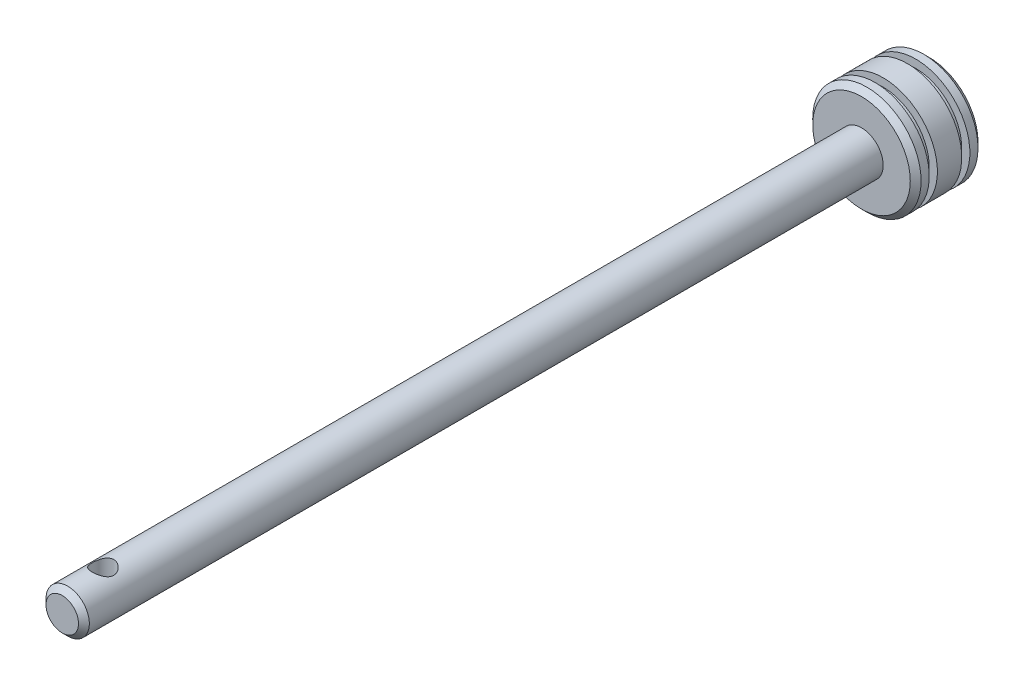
ISO-10303-21;
HEADER;
FILE_DESCRIPTION(('STEP AP214'),'2;1');
FILE_NAME('part.step','',(''),(''),'','','');
FILE_SCHEMA(('AUTOMOTIVE_DESIGN { 1 0 10303 214 1 1 1 1 }'));
ENDSEC;
DATA;
#1=APPLICATION_CONTEXT('core data for automotive mechanical design processes');
#2=APPLICATION_PROTOCOL_DEFINITION('international standard','automotive_design',2000,#1);
#3=PRODUCT_CONTEXT('',#1,'mechanical');
#4=PRODUCT('Part','Part','',(#3));
#5=PRODUCT_RELATED_PRODUCT_CATEGORY('part','',(#4));
#6=PRODUCT_DEFINITION_FORMATION('','',#4);
#7=PRODUCT_DEFINITION_CONTEXT('part definition',#1,'design');
#8=PRODUCT_DEFINITION('design','',#6,#7);
#9=PRODUCT_DEFINITION_SHAPE('','',#8);
#10=(LENGTH_UNIT() NAMED_UNIT(*) SI_UNIT(.MILLI.,.METRE.));
#11=(NAMED_UNIT(*) PLANE_ANGLE_UNIT() SI_UNIT($,.RADIAN.));
#12=(NAMED_UNIT(*) SI_UNIT($,.STERADIAN.) SOLID_ANGLE_UNIT());
#13=UNCERTAINTY_MEASURE_WITH_UNIT(LENGTH_MEASURE(1.E-05),#10,'distance_accuracy_value','');
#14=(GEOMETRIC_REPRESENTATION_CONTEXT(3) GLOBAL_UNCERTAINTY_ASSIGNED_CONTEXT((#13)) GLOBAL_UNIT_ASSIGNED_CONTEXT((#10,
#11,#12)) REPRESENTATION_CONTEXT('',''));
#15=CARTESIAN_POINT('',(0.,0.,0.));
#16=DIRECTION('',(0.,0.,1.));
#17=DIRECTION('',(1.,0.,0.));
#18=AXIS2_PLACEMENT_3D('',#15,#16,#17);
#19=CARTESIAN_POINT('',(0.,0.,25.));
#20=DIRECTION('',(0.,0.,-1.));
#21=DIRECTION('',(-1.,0.,0.));
#22=AXIS2_PLACEMENT_3D('',#19,#20,#21);
#23=CYLINDRICAL_SURFACE('',#22,20.);
#24=CARTESIAN_POINT('',(0.,0.,20.));
#25=DIRECTION('',(0.,0.,-1.));
#26=DIRECTION('',(-1.,0.,0.));
#27=AXIS2_PLACEMENT_3D('',#24,#25,#26);
#28=CIRCLE('',#27,20.);
#29=CARTESIAN_POINT('',(-20.,0.,20.));
#30=VERTEX_POINT('',#29);
#31=EDGE_CURVE('E151',#30,#30,#28,.T.);
#32=ORIENTED_EDGE('',*,*,#31,.F.);
#33=EDGE_LOOP('',(#32));
#34=FACE_BOUND('',#33,.T.);
#35=CARTESIAN_POINT('',(0.,0.,23.));
#36=DIRECTION('',(0.,0.,1.));
#37=DIRECTION('',(1.,0.,0.));
#38=AXIS2_PLACEMENT_3D('',#35,#36,#37);
#39=CIRCLE('',#38,20.);
#40=CARTESIAN_POINT('',(20.,0.,23.));
#41=VERTEX_POINT('',#40);
#42=EDGE_CURVE('E126',#41,#41,#39,.F.);
#43=ORIENTED_EDGE('',*,*,#42,.T.);
#44=EDGE_LOOP('',(#43));
#45=FACE_BOUND('',#44,.T.);
#46=ADVANCED_FACE('F24',(#34,#45),#23,.T.);
#47=CARTESIAN_POINT('',(0.,0.,25.));
#48=DIRECTION('',(0.,0.,1.));
#49=DIRECTION('',(1.,0.,0.));
#50=AXIS2_PLACEMENT_3D('',#47,#48,#49);
#51=PLANE('',#50);
#52=CARTESIAN_POINT('',(0.,0.,25.));
#53=DIRECTION('',(0.,0.,1.));
#54=DIRECTION('',(1.,0.,0.));
#55=AXIS2_PLACEMENT_3D('',#52,#53,#54);
#56=CIRCLE('',#55,18.);
#57=CARTESIAN_POINT('',(18.,0.,25.));
#58=VERTEX_POINT('',#57);
#59=EDGE_CURVE('E41',#58,#58,#56,.T.);
#60=ORIENTED_EDGE('',*,*,#59,.T.);
#61=EDGE_LOOP('',(#60));
#62=FACE_BOUND('',#61,.T.);
#63=CARTESIAN_POINT('',(0.,0.,25.));
#64=DIRECTION('',(0.,0.,1.));
#65=DIRECTION('',(1.,0.,0.));
#66=AXIS2_PLACEMENT_3D('',#63,#64,#65);
#67=CIRCLE('',#66,8.);
#68=CARTESIAN_POINT('',(8.,0.,25.));
#69=VERTEX_POINT('',#68);
#70=EDGE_CURVE('E131',#69,#69,#67,.T.);
#71=ORIENTED_EDGE('',*,*,#70,.F.);
#72=EDGE_LOOP('',(#71));
#73=FACE_BOUND('',#72,.T.);
#74=ADVANCED_FACE('F102',(#62,#73),#51,.T.);
#75=CARTESIAN_POINT('',(0.,0.,320.));
#76=DIRECTION('',(0.,0.,-1.));
#77=DIRECTION('',(-1.,0.,0.));
#78=AXIS2_PLACEMENT_3D('',#75,#76,#77);
#79=CYLINDRICAL_SURFACE('',#78,8.);
#80=CARTESIAN_POINT('',(0.,-8.,309.));
#81=CARTESIAN_POINT('',(0.105191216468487,-7.99999964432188,308.999999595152));
#82=CARTESIAN_POINT('',(0.210389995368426,-7.99792027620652,308.995845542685));
#83=CARTESIAN_POINT('',(0.420011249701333,-7.98965597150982,308.979277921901));
#84=CARTESIAN_POINT('',(0.524433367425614,-7.98346924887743,308.96686076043));
#85=CARTESIAN_POINT('',(0.731828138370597,-7.96713597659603,308.933886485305));
#86=CARTESIAN_POINT('',(0.834798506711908,-7.95698378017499,308.913317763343));
#87=CARTESIAN_POINT('',(1.03841520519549,-7.93298382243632,308.864282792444));
#88=CARTESIAN_POINT('',(1.1390605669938,-7.91913455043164,308.835813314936));
#89=CARTESIAN_POINT('',(1.43561775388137,-7.87265974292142,308.739251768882));
#90=CARTESIAN_POINT('',(1.62719620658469,-7.83501976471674,308.659837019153));
#91=CARTESIAN_POINT('',(1.9939214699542,-7.74982886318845,308.473710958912));
#92=CARTESIAN_POINT('',(2.16906957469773,-7.70227872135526,308.367001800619));
#93=CARTESIAN_POINT('',(2.51002321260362,-7.59825056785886,308.121930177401));
#94=CARTESIAN_POINT('',(2.67462250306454,-7.54140647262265,307.982043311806));
#95=CARTESIAN_POINT('',(2.97911611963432,-7.42640030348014,307.677924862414));
#96=CARTESIAN_POINT('',(3.11899161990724,-7.3682372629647,307.513674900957));
#97=CARTESIAN_POINT('',(3.38102385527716,-7.25195135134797,307.15002101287));
#98=CARTESIAN_POINT('',(3.50096528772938,-7.19418138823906,306.948878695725));
#99=CARTESIAN_POINT('',(3.65378721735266,-7.11709930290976,306.632065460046));
#100=CARTESIAN_POINT('',(3.70022392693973,-7.09299422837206,306.523905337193));
#101=CARTESIAN_POINT('',(3.78359067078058,-7.04887690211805,306.303199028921));
#102=CARTESIAN_POINT('',(3.82052633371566,-7.02886222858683,306.190655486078));
#103=CARTESIAN_POINT('',(3.88251046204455,-6.99480449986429,305.968805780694));
#104=CARTESIAN_POINT('',(3.90813408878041,-6.98047764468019,305.859703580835));
#105=CARTESIAN_POINT('',(3.95018060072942,-6.95677065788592,305.63925947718));
#106=CARTESIAN_POINT('',(3.96660836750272,-6.94738790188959,305.527918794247));
#107=CARTESIAN_POINT('',(3.99001913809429,-6.93396933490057,305.303993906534));
#108=CARTESIAN_POINT('',(3.99700782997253,-6.92993030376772,305.191410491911));
#109=CARTESIAN_POINT('',(4.00144340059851,-6.92737022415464,304.965999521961));
#110=CARTESIAN_POINT('',(3.99889118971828,-6.92884864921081,304.853171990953));
#111=CARTESIAN_POINT('',(3.98516575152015,-6.93675038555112,304.641835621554));
#112=CARTESIAN_POINT('',(3.9750632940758,-6.94255931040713,304.543232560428));
#113=CARTESIAN_POINT('',(3.94763759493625,-6.95818925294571,304.347348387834));
#114=CARTESIAN_POINT('',(3.9303120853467,-6.96801153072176,304.25006770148));
#115=CARTESIAN_POINT('',(3.86777248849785,-7.00304835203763,303.9612208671));
#116=CARTESIAN_POINT('',(3.81198555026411,-7.03383903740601,303.772504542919));
#117=CARTESIAN_POINT('',(3.6728359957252,-7.10749917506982,303.403053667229));
#118=CARTESIAN_POINT('',(3.58886132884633,-7.15063327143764,303.222607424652));
#119=CARTESIAN_POINT('',(3.39616568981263,-7.2441365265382,302.877469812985));
#120=CARTESIAN_POINT('',(3.28743360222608,-7.29450893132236,302.712785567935));
#121=CARTESIAN_POINT('',(3.03227252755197,-7.40452458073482,302.381917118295));
#122=CARTESIAN_POINT('',(2.88281182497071,-7.46453347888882,302.218190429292));
#123=CARTESIAN_POINT('',(2.55818830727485,-7.58191186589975,301.9170403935));
#124=CARTESIAN_POINT('',(2.38301327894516,-7.63928008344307,301.779629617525));
#125=CARTESIAN_POINT('',(2.09944472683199,-7.72027607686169,301.593246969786));
#126=CARTESIAN_POINT('',(1.9989679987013,-7.74696304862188,301.533318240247));
#127=CARTESIAN_POINT('',(1.79256850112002,-7.79730441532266,301.422233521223));
#128=CARTESIAN_POINT('',(1.68664805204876,-7.82096008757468,301.371073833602));
#129=CARTESIAN_POINT('',(1.47010242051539,-7.86454042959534,301.278080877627));
#130=CARTESIAN_POINT('',(1.35947915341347,-7.88446660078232,301.236243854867));
#131=CARTESIAN_POINT('',(1.13432950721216,-7.91999221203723,301.162380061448));
#132=CARTESIAN_POINT('',(1.01980357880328,-7.9355921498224,301.130352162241));
#133=CARTESIAN_POINT('',(0.797438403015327,-7.96087677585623,301.078773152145));
#134=CARTESIAN_POINT('',(0.689830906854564,-7.9709443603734,301.058408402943));
#135=CARTESIAN_POINT('',(0.47299872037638,-7.98674429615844,301.026553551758));
#136=CARTESIAN_POINT('',(0.363774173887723,-7.99247703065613,301.015062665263));
#137=CARTESIAN_POINT('',(0.144648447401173,-7.99944300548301,301.001109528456));
#138=CARTESIAN_POINT('',(0.0347475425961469,-8.00067796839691,300.998643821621));
#139=CARTESIAN_POINT('',(-0.184837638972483,-7.99861804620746,301.00276424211));
#140=CARTESIAN_POINT('',(-0.294521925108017,-7.99532336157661,301.009349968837));
#141=CARTESIAN_POINT('',(-0.504259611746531,-7.98472734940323,301.030623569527));
#142=CARTESIAN_POINT('',(-0.604398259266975,-7.97775776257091,301.044641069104));
#143=CARTESIAN_POINT('',(-0.803035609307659,-7.96021983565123,301.080136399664));
#144=CARTESIAN_POINT('',(-0.901533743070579,-7.94965027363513,301.101616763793));
#145=CARTESIAN_POINT('',(-1.19351737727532,-7.91289127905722,301.1769351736));
#146=CARTESIAN_POINT('',(-1.38368108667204,-7.88164133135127,301.241670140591));
#147=CARTESIAN_POINT('',(-1.75558493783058,-7.80736894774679,301.399998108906));
#148=CARTESIAN_POINT('',(-1.93692876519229,-7.76403545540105,301.494363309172));
#149=CARTESIAN_POINT('',(-2.28183826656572,-7.66975878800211,301.70843103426));
#150=CARTESIAN_POINT('',(-2.44539632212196,-7.61881237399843,301.828144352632));
#151=CARTESIAN_POINT('',(-2.76706877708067,-7.50833088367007,302.103033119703));
#152=CARTESIAN_POINT('',(-2.92307134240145,-7.44844369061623,302.260536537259));
#153=CARTESIAN_POINT('',(-3.20744226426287,-7.33048735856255,302.599735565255));
#154=CARTESIAN_POINT('',(-3.33579150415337,-7.27241950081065,302.781447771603));
#155=CARTESIAN_POINT('',(-3.50772930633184,-7.1902816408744,303.073994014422));
#156=CARTESIAN_POINT('',(-3.56261578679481,-7.16316684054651,303.177483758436));
#157=CARTESIAN_POINT('',(-3.66334616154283,-7.11217812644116,303.389518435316));
#158=CARTESIAN_POINT('',(-3.70919441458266,-7.08830265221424,303.498060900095));
#159=CARTESIAN_POINT('',(-3.79131200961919,-7.04472262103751,303.719421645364));
#160=CARTESIAN_POINT('',(-3.82758904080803,-7.02501471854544,303.832236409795));
#161=CARTESIAN_POINT('',(-3.8901200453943,-6.99058253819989,304.061352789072));
#162=CARTESIAN_POINT('',(-3.91637557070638,-6.9758574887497,304.177653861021));
#163=CARTESIAN_POINT('',(-3.95643062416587,-6.9532102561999,304.401412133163));
#164=CARTESIAN_POINT('',(-3.97118378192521,-6.94477079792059,304.508646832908));
#165=CARTESIAN_POINT('',(-3.99195118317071,-6.93285441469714,304.724227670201));
#166=CARTESIAN_POINT('',(-3.99796634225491,-6.92937696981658,304.832573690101));
#167=CARTESIAN_POINT('',(-4.00116308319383,-6.92753208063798,305.04940749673));
#168=CARTESIAN_POINT('',(-3.9983477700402,-6.92916284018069,305.157895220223));
#169=CARTESIAN_POINT('',(-3.98394653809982,-6.9374509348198,305.374061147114));
#170=CARTESIAN_POINT('',(-3.97236097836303,-6.94410806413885,305.481739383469));
#171=CARTESIAN_POINT('',(-3.92770249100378,-6.9695287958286,305.781800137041));
#172=CARTESIAN_POINT('',(-3.88483285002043,-6.99372760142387,305.972365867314));
#173=CARTESIAN_POINT('',(-3.77270184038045,-7.05483682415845,306.343268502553));
#174=CARTESIAN_POINT('',(-3.70343198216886,-7.09175132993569,306.523602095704));
#175=CARTESIAN_POINT('',(-3.53526338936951,-7.17714225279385,306.882488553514));
#176=CARTESIAN_POINT('',(-3.43468670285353,-7.22622883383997,307.060107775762));
#177=CARTESIAN_POINT('',(-3.20860173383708,-7.3294133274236,307.397101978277));
#178=CARTESIAN_POINT('',(-3.08308048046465,-7.38351383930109,307.556467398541));
#179=CARTESIAN_POINT('',(-2.7928225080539,-7.49849148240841,307.872562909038));
#180=CARTESIAN_POINT('',(-2.625174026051,-7.55939328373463,308.026619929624));
#181=CARTESIAN_POINT('',(-2.26458287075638,-7.67511613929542,308.305068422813));
#182=CARTESIAN_POINT('',(-2.0716266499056,-7.72993390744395,308.429443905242));
#183=CARTESIAN_POINT('',(-1.76603106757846,-7.80335210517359,308.590904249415));
#184=CARTESIAN_POINT('',(-1.66100410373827,-7.82643367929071,308.640693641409));
#185=CARTESIAN_POINT('',(-1.44639623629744,-7.8689179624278,308.731148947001));
#186=CARTESIAN_POINT('',(-1.33681760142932,-7.8883224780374,308.771819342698));
#187=CARTESIAN_POINT('',(-1.11415600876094,-7.92283587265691,308.843476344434));
#188=CARTESIAN_POINT('',(-1.00108129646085,-7.93795411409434,308.874484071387));
#189=CARTESIAN_POINT('',(-0.772189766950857,-7.96347694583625,308.926510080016));
#190=CARTESIAN_POINT('',(-0.65637467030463,-7.97388441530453,308.947534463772));
#191=CARTESIAN_POINT('',(-0.450433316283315,-7.98781110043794,308.975579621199));
#192=CARTESIAN_POINT('',(-0.36066062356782,-7.99237392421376,308.984729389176));
#193=CARTESIAN_POINT('',(-0.18059382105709,-7.99846856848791,308.996939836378));
#194=CARTESIAN_POINT('',(-0.090299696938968,-8.00000030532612,309.000000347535));
#195=CARTESIAN_POINT('',(0.,-8.,309.));
#196=B_SPLINE_CURVE_WITH_KNOTS('',3,(#80,#81,#82,#83,#84,#85,#86,#87,#88,#89,#90,#91,#92,#93,
#94,#95,#96,#97,#98,#99,#100,#101,#102,#103,#104,#105,#106,#107,#108,#109,#110,#111,#112,#113,
#114,#115,#116,#117,#118,#119,#120,#121,#122,#123,#124,#125,#126,#127,#128,#129,#130,#131,#132,
#133,#134,#135,#136,#137,#138,#139,#140,#141,#142,#143,#144,#145,#146,#147,#148,#149,#150,#151,
#152,#153,#154,#155,#156,#157,#158,#159,#160,#161,#162,#163,#164,#165,#166,#167,#168,#169,#170,
#171,#172,#173,#174,#175,#176,#177,#178,#179,#180,#181,#182,#183,#184,#185,#186,#187,#188,#189,
#190,#191,#192,#193,#194,#195),.UNSPECIFIED.,.T.,.F.,(4,2,2,2,2,2,2,2,2,2,2,2,2,2,2,2,2,2,2,2,2,
2,2,2,2,2,2,2,2,2,2,2,2,2,2,2,2,2,2,2,2,2,2,2,2,2,2,2,2,2,2,2,2,2,2,2,2,4),(0.,
0.315484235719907,0.631105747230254,0.947178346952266,1.26338029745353,1.89263632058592,
2.52184274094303,3.18911473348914,3.85689264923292,4.57645675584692,4.93648208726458,
5.29629363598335,5.63476191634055,5.97305035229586,6.31113484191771,6.64918707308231,
6.9466914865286,7.24428938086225,7.83905304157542,8.44767049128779,9.05656173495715,
9.74265853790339,10.4290822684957,10.7886699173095,11.1481055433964,11.5073961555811,
11.8666454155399,12.1961419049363,12.5256092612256,12.8549504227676,13.184277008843,
13.4879760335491,13.791778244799,14.3988188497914,15.0232162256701,15.6478800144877,
16.33388641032,17.0203655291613,17.380682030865,17.7408243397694,18.1006764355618,
18.4604727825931,18.7857371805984,19.1109674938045,19.4360834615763,19.7611861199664,
20.3488209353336,20.9366448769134,21.5639619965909,22.1916061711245,22.8955134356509,
23.5997990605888,23.9548906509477,24.3098073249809,24.6639426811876,25.0178613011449,
25.2886761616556,25.5594984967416),.UNSPECIFIED.);
#197=CARTESIAN_POINT('',(0.,-8.,309.));
#198=VERTEX_POINT('',#197);
#199=EDGE_CURVE('E28',#198,#198,#196,.T.);
#200=ORIENTED_EDGE('',*,*,#199,.T.);
#201=EDGE_LOOP('',(#200));
#202=FACE_BOUND('',#201,.T.);
#203=CARTESIAN_POINT('',(0.,8.,309.));
#204=CARTESIAN_POINT('',(-0.105191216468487,7.99999964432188,308.999999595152));
#205=CARTESIAN_POINT('',(-0.210389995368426,7.99792027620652,308.995845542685));
#206=CARTESIAN_POINT('',(-0.420011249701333,7.98965597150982,308.979277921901));
#207=CARTESIAN_POINT('',(-0.524433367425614,7.98346924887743,308.96686076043));
#208=CARTESIAN_POINT('',(-0.731828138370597,7.96713597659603,308.933886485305));
#209=CARTESIAN_POINT('',(-0.834798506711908,7.95698378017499,308.913317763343));
#210=CARTESIAN_POINT('',(-1.03841520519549,7.93298382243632,308.864282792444));
#211=CARTESIAN_POINT('',(-1.1390605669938,7.91913455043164,308.835813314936));
#212=CARTESIAN_POINT('',(-1.43561775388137,7.87265974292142,308.739251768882));
#213=CARTESIAN_POINT('',(-1.62719620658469,7.83501976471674,308.659837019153));
#214=CARTESIAN_POINT('',(-1.9939214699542,7.74982886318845,308.473710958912));
#215=CARTESIAN_POINT('',(-2.16906957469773,7.70227872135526,308.367001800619));
#216=CARTESIAN_POINT('',(-2.51002321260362,7.59825056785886,308.121930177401));
#217=CARTESIAN_POINT('',(-2.67462250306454,7.54140647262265,307.982043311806));
#218=CARTESIAN_POINT('',(-2.97911611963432,7.42640030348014,307.677924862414));
#219=CARTESIAN_POINT('',(-3.11899161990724,7.3682372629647,307.513674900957));
#220=CARTESIAN_POINT('',(-3.38102385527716,7.25195135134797,307.15002101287));
#221=CARTESIAN_POINT('',(-3.50096528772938,7.19418138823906,306.948878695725));
#222=CARTESIAN_POINT('',(-3.65378721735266,7.11709930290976,306.632065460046));
#223=CARTESIAN_POINT('',(-3.70022392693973,7.09299422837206,306.523905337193));
#224=CARTESIAN_POINT('',(-3.78359067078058,7.04887690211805,306.303199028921));
#225=CARTESIAN_POINT('',(-3.82052633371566,7.02886222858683,306.190655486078));
#226=CARTESIAN_POINT('',(-3.88251046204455,6.99480449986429,305.968805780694));
#227=CARTESIAN_POINT('',(-3.90813408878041,6.98047764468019,305.859703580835));
#228=CARTESIAN_POINT('',(-3.95018060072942,6.95677065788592,305.63925947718));
#229=CARTESIAN_POINT('',(-3.96660836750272,6.94738790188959,305.527918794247));
#230=CARTESIAN_POINT('',(-3.99001913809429,6.93396933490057,305.303993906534));
#231=CARTESIAN_POINT('',(-3.99700782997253,6.92993030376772,305.191410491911));
#232=CARTESIAN_POINT('',(-4.00144340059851,6.92737022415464,304.965999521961));
#233=CARTESIAN_POINT('',(-3.99889118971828,6.92884864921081,304.853171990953));
#234=CARTESIAN_POINT('',(-3.98516575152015,6.93675038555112,304.641835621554));
#235=CARTESIAN_POINT('',(-3.9750632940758,6.94255931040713,304.543232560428));
#236=CARTESIAN_POINT('',(-3.94763759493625,6.95818925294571,304.347348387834));
#237=CARTESIAN_POINT('',(-3.9303120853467,6.96801153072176,304.25006770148));
#238=CARTESIAN_POINT('',(-3.86777248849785,7.00304835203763,303.9612208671));
#239=CARTESIAN_POINT('',(-3.81198555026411,7.03383903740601,303.772504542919));
#240=CARTESIAN_POINT('',(-3.6728359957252,7.10749917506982,303.403053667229));
#241=CARTESIAN_POINT('',(-3.58886132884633,7.15063327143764,303.222607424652));
#242=CARTESIAN_POINT('',(-3.39616568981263,7.2441365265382,302.877469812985));
#243=CARTESIAN_POINT('',(-3.28743360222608,7.29450893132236,302.712785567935));
#244=CARTESIAN_POINT('',(-3.03227252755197,7.40452458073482,302.381917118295));
#245=CARTESIAN_POINT('',(-2.88281182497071,7.46453347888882,302.218190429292));
#246=CARTESIAN_POINT('',(-2.55818830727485,7.58191186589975,301.9170403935));
#247=CARTESIAN_POINT('',(-2.38301327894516,7.63928008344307,301.779629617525));
#248=CARTESIAN_POINT('',(-2.09944472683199,7.72027607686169,301.593246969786));
#249=CARTESIAN_POINT('',(-1.9989679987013,7.74696304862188,301.533318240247));
#250=CARTESIAN_POINT('',(-1.79256850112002,7.79730441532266,301.422233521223));
#251=CARTESIAN_POINT('',(-1.68664805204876,7.82096008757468,301.371073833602));
#252=CARTESIAN_POINT('',(-1.47010242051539,7.86454042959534,301.278080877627));
#253=CARTESIAN_POINT('',(-1.35947915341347,7.88446660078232,301.236243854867));
#254=CARTESIAN_POINT('',(-1.13432950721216,7.91999221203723,301.162380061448));
#255=CARTESIAN_POINT('',(-1.01980357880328,7.9355921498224,301.130352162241));
#256=CARTESIAN_POINT('',(-0.797438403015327,7.96087677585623,301.078773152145));
#257=CARTESIAN_POINT('',(-0.689830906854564,7.9709443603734,301.058408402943));
#258=CARTESIAN_POINT('',(-0.47299872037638,7.98674429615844,301.026553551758));
#259=CARTESIAN_POINT('',(-0.363774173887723,7.99247703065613,301.015062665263));
#260=CARTESIAN_POINT('',(-0.144648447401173,7.99944300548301,301.001109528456));
#261=CARTESIAN_POINT('',(-0.0347475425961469,8.00067796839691,300.998643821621));
#262=CARTESIAN_POINT('',(0.184837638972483,7.99861804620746,301.00276424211));
#263=CARTESIAN_POINT('',(0.294521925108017,7.99532336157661,301.009349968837));
#264=CARTESIAN_POINT('',(0.504259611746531,7.98472734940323,301.030623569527));
#265=CARTESIAN_POINT('',(0.604398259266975,7.97775776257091,301.044641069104));
#266=CARTESIAN_POINT('',(0.803035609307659,7.96021983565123,301.080136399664));
#267=CARTESIAN_POINT('',(0.901533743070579,7.94965027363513,301.101616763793));
#268=CARTESIAN_POINT('',(1.19351737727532,7.91289127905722,301.1769351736));
#269=CARTESIAN_POINT('',(1.38368108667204,7.88164133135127,301.241670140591));
#270=CARTESIAN_POINT('',(1.75558493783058,7.80736894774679,301.399998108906));
#271=CARTESIAN_POINT('',(1.93692876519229,7.76403545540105,301.494363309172));
#272=CARTESIAN_POINT('',(2.28183826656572,7.66975878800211,301.70843103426));
#273=CARTESIAN_POINT('',(2.44539632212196,7.61881237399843,301.828144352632));
#274=CARTESIAN_POINT('',(2.76706877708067,7.50833088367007,302.103033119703));
#275=CARTESIAN_POINT('',(2.92307134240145,7.44844369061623,302.260536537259));
#276=CARTESIAN_POINT('',(3.20744226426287,7.33048735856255,302.599735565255));
#277=CARTESIAN_POINT('',(3.33579150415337,7.27241950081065,302.781447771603));
#278=CARTESIAN_POINT('',(3.50772930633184,7.1902816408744,303.073994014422));
#279=CARTESIAN_POINT('',(3.56261578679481,7.16316684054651,303.177483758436));
#280=CARTESIAN_POINT('',(3.66334616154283,7.11217812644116,303.389518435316));
#281=CARTESIAN_POINT('',(3.70919441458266,7.08830265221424,303.498060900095));
#282=CARTESIAN_POINT('',(3.79131200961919,7.04472262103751,303.719421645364));
#283=CARTESIAN_POINT('',(3.82758904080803,7.02501471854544,303.832236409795));
#284=CARTESIAN_POINT('',(3.8901200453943,6.99058253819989,304.061352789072));
#285=CARTESIAN_POINT('',(3.91637557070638,6.9758574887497,304.177653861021));
#286=CARTESIAN_POINT('',(3.95643062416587,6.9532102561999,304.401412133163));
#287=CARTESIAN_POINT('',(3.97118378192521,6.94477079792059,304.508646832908));
#288=CARTESIAN_POINT('',(3.99195118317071,6.93285441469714,304.724227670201));
#289=CARTESIAN_POINT('',(3.99796634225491,6.92937696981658,304.832573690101));
#290=CARTESIAN_POINT('',(4.00116308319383,6.92753208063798,305.04940749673));
#291=CARTESIAN_POINT('',(3.9983477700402,6.92916284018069,305.157895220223));
#292=CARTESIAN_POINT('',(3.98394653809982,6.9374509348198,305.374061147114));
#293=CARTESIAN_POINT('',(3.97236097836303,6.94410806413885,305.481739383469));
#294=CARTESIAN_POINT('',(3.92770249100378,6.9695287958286,305.781800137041));
#295=CARTESIAN_POINT('',(3.88483285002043,6.99372760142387,305.972365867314));
#296=CARTESIAN_POINT('',(3.77270184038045,7.05483682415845,306.343268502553));
#297=CARTESIAN_POINT('',(3.70343198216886,7.09175132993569,306.523602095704));
#298=CARTESIAN_POINT('',(3.53526338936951,7.17714225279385,306.882488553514));
#299=CARTESIAN_POINT('',(3.43468670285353,7.22622883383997,307.060107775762));
#300=CARTESIAN_POINT('',(3.20860173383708,7.3294133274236,307.397101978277));
#301=CARTESIAN_POINT('',(3.08308048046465,7.38351383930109,307.556467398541));
#302=CARTESIAN_POINT('',(2.7928225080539,7.49849148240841,307.872562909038));
#303=CARTESIAN_POINT('',(2.625174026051,7.55939328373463,308.026619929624));
#304=CARTESIAN_POINT('',(2.26458287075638,7.67511613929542,308.305068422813));
#305=CARTESIAN_POINT('',(2.0716266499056,7.72993390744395,308.429443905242));
#306=CARTESIAN_POINT('',(1.76603106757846,7.80335210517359,308.590904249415));
#307=CARTESIAN_POINT('',(1.66100410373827,7.82643367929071,308.640693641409));
#308=CARTESIAN_POINT('',(1.44639623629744,7.8689179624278,308.731148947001));
#309=CARTESIAN_POINT('',(1.33681760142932,7.8883224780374,308.771819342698));
#310=CARTESIAN_POINT('',(1.11415600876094,7.92283587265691,308.843476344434));
#311=CARTESIAN_POINT('',(1.00108129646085,7.93795411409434,308.874484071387));
#312=CARTESIAN_POINT('',(0.772189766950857,7.96347694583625,308.926510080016));
#313=CARTESIAN_POINT('',(0.65637467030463,7.97388441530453,308.947534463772));
#314=CARTESIAN_POINT('',(0.450433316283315,7.98781110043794,308.975579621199));
#315=CARTESIAN_POINT('',(0.36066062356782,7.99237392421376,308.984729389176));
#316=CARTESIAN_POINT('',(0.18059382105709,7.99846856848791,308.996939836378));
#317=CARTESIAN_POINT('',(0.090299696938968,8.00000030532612,309.000000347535));
#318=CARTESIAN_POINT('',(0.,8.,309.));
#319=B_SPLINE_CURVE_WITH_KNOTS('',3,(#203,#204,#205,#206,#207,#208,#209,#210,#211,#212,#213,
#214,#215,#216,#217,#218,#219,#220,#221,#222,#223,#224,#225,#226,#227,#228,#229,#230,#231,#232,
#233,#234,#235,#236,#237,#238,#239,#240,#241,#242,#243,#244,#245,#246,#247,#248,#249,#250,#251,
#252,#253,#254,#255,#256,#257,#258,#259,#260,#261,#262,#263,#264,#265,#266,#267,#268,#269,#270,
#271,#272,#273,#274,#275,#276,#277,#278,#279,#280,#281,#282,#283,#284,#285,#286,#287,#288,#289,
#290,#291,#292,#293,#294,#295,#296,#297,#298,#299,#300,#301,#302,#303,#304,#305,#306,#307,#308,
#309,#310,#311,#312,#313,#314,#315,#316,#317,#318),.UNSPECIFIED.,.T.,.F.,(4,2,2,2,2,2,2,2,2,2,2,
2,2,2,2,2,2,2,2,2,2,2,2,2,2,2,2,2,2,2,2,2,2,2,2,2,2,2,2,2,2,2,2,2,2,2,2,2,2,2,2,2,2,2,2,2,2,4),
(0.,0.315484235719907,0.631105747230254,0.947178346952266,1.26338029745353,1.89263632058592,
2.52184274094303,3.18911473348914,3.85689264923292,4.57645675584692,4.93648208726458,
5.29629363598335,5.63476191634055,5.97305035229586,6.31113484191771,6.64918707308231,
6.9466914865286,7.24428938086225,7.83905304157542,8.44767049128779,9.05656173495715,
9.74265853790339,10.4290822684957,10.7886699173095,11.1481055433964,11.5073961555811,
11.8666454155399,12.1961419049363,12.5256092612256,12.8549504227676,13.184277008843,
13.4879760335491,13.791778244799,14.3988188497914,15.0232162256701,15.6478800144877,
16.33388641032,17.0203655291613,17.380682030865,17.7408243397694,18.1006764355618,
18.4604727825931,18.7857371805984,19.1109674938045,19.4360834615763,19.7611861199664,
20.3488209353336,20.9366448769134,21.5639619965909,22.1916061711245,22.8955134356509,
23.5997990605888,23.9548906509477,24.3098073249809,24.6639426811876,25.0178613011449,
25.2886761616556,25.5594984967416),.UNSPECIFIED.);
#320=CARTESIAN_POINT('',(0.,8.,309.));
#321=VERTEX_POINT('',#320);
#322=EDGE_CURVE('E44',#321,#321,#319,.T.);
#323=ORIENTED_EDGE('',*,*,#322,.T.);
#324=EDGE_LOOP('',(#323));
#325=FACE_BOUND('',#324,.T.);
#326=CARTESIAN_POINT('',(0.,0.,318.));
#327=DIRECTION('',(0.,0.,1.));
#328=DIRECTION('',(1.,0.,0.));
#329=AXIS2_PLACEMENT_3D('',#326,#327,#328);
#330=CIRCLE('',#329,8.);
#331=CARTESIAN_POINT('',(8.,0.,318.));
#332=VERTEX_POINT('',#331);
#333=EDGE_CURVE('E10',#332,#332,#330,.F.);
#334=ORIENTED_EDGE('',*,*,#333,.T.);
#335=EDGE_LOOP('',(#334));
#336=FACE_BOUND('',#335,.T.);
#337=ORIENTED_EDGE('',*,*,#70,.T.);
#338=EDGE_LOOP('',(#337));
#339=FACE_BOUND('',#338,.T.);
#340=ADVANCED_FACE('F48',(#202,#325,#336,#339),#79,.T.);
#341=CARTESIAN_POINT('',(0.,0.,320.));
#342=DIRECTION('',(0.,0.,1.));
#343=DIRECTION('',(1.,0.,0.));
#344=AXIS2_PLACEMENT_3D('',#341,#342,#343);
#345=PLANE('',#344);
#346=CARTESIAN_POINT('',(0.,0.,320.));
#347=DIRECTION('',(0.,0.,1.));
#348=DIRECTION('',(1.,0.,0.));
#349=AXIS2_PLACEMENT_3D('',#346,#347,#348);
#350=CIRCLE('',#349,6.);
#351=CARTESIAN_POINT('',(6.,0.,320.));
#352=VERTEX_POINT('',#351);
#353=EDGE_CURVE('E36',#352,#352,#350,.T.);
#354=ORIENTED_EDGE('',*,*,#353,.T.);
#355=EDGE_LOOP('',(#354));
#356=FACE_BOUND('',#355,.T.);
#357=ADVANCED_FACE('F91',(#356),#345,.T.);
#358=CARTESIAN_POINT('',(0.,0.,25.));
#359=DIRECTION('',(0.,0.,-1.));
#360=DIRECTION('',(-1.,0.,0.));
#361=AXIS2_PLACEMENT_3D('',#358,#359,#360);
#362=CONICAL_SURFACE('',#361,18.,0.785398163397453);
#363=ORIENTED_EDGE('',*,*,#42,.F.);
#364=EDGE_LOOP('',(#363));
#365=FACE_BOUND('',#364,.T.);
#366=ORIENTED_EDGE('',*,*,#59,.F.);
#367=EDGE_LOOP('',(#366));
#368=FACE_BOUND('',#367,.T.);
#369=ADVANCED_FACE('F87',(#365,#368),#362,.T.);
#370=CARTESIAN_POINT('',(0.,20.,20.));
#371=DIRECTION('',(0.,0.,1.));
#372=DIRECTION('',(1.,0.,0.));
#373=AXIS2_PLACEMENT_3D('',#370,#371,#372);
#374=PLANE('',#373);
#375=CARTESIAN_POINT('',(0.,0.,20.));
#376=DIRECTION('',(0.,0.,-1.));
#377=DIRECTION('',(-1.,0.,0.));
#378=AXIS2_PLACEMENT_3D('',#375,#376,#377);
#379=CIRCLE('',#378,17.);
#380=CARTESIAN_POINT('',(-17.,0.,20.));
#381=VERTEX_POINT('',#380);
#382=EDGE_CURVE('E141',#381,#381,#379,.T.);
#383=ORIENTED_EDGE('',*,*,#382,.F.);
#384=EDGE_LOOP('',(#383));
#385=FACE_BOUND('',#384,.T.);
#386=ORIENTED_EDGE('',*,*,#31,.T.);
#387=EDGE_LOOP('',(#386));
#388=FACE_BOUND('',#387,.T.);
#389=ADVANCED_FACE('F83',(#385,#388),#374,.F.);
#390=CARTESIAN_POINT('',(0.,0.,0.));
#391=DIRECTION('',(0.,0.,-1.));
#392=DIRECTION('',(-1.,0.,0.));
#393=AXIS2_PLACEMENT_3D('',#390,#391,#392);
#394=CYLINDRICAL_SURFACE('',#393,17.);
#395=CARTESIAN_POINT('',(0.,0.,17.));
#396=DIRECTION('',(0.,0.,-1.));
#397=DIRECTION('',(-1.,0.,0.));
#398=AXIS2_PLACEMENT_3D('',#395,#396,#397);
#399=CIRCLE('',#398,17.);
#400=CARTESIAN_POINT('',(-17.,0.,17.));
#401=VERTEX_POINT('',#400);
#402=EDGE_CURVE('E143',#401,#401,#399,.T.);
#403=ORIENTED_EDGE('',*,*,#402,.F.);
#404=EDGE_LOOP('',(#403));
#405=FACE_BOUND('',#404,.T.);
#406=ORIENTED_EDGE('',*,*,#382,.T.);
#407=EDGE_LOOP('',(#406));
#408=FACE_BOUND('',#407,.T.);
#409=ADVANCED_FACE('F79',(#405,#408),#394,.T.);
#410=CARTESIAN_POINT('',(0.,20.,17.));
#411=DIRECTION('',(0.,0.,-1.));
#412=DIRECTION('',(-1.,0.,0.));
#413=AXIS2_PLACEMENT_3D('',#410,#411,#412);
#414=PLANE('',#413);
#415=CARTESIAN_POINT('',(0.,0.,17.));
#416=DIRECTION('',(0.,0.,-1.));
#417=DIRECTION('',(-1.,0.,0.));
#418=AXIS2_PLACEMENT_3D('',#415,#416,#417);
#419=CIRCLE('',#418,20.);
#420=CARTESIAN_POINT('',(-20.,0.,17.));
#421=VERTEX_POINT('',#420);
#422=EDGE_CURVE('E148',#421,#421,#419,.T.);
#423=ORIENTED_EDGE('',*,*,#422,.F.);
#424=EDGE_LOOP('',(#423));
#425=FACE_BOUND('',#424,.T.);
#426=ORIENTED_EDGE('',*,*,#402,.T.);
#427=EDGE_LOOP('',(#426));
#428=FACE_BOUND('',#427,.T.);
#429=ADVANCED_FACE('F76',(#425,#428),#414,.F.);
#430=CARTESIAN_POINT('',(0.,0.,8.));
#431=DIRECTION('',(0.,0.,-1.));
#432=DIRECTION('',(-1.,0.,0.));
#433=AXIS2_PLACEMENT_3D('',#430,#431,#432);
#434=CIRCLE('',#433,20.);
#435=CARTESIAN_POINT('',(-20.,0.,8.));
#436=VERTEX_POINT('',#435);
#437=EDGE_CURVE('E160',#436,#436,#434,.T.);
#438=ORIENTED_EDGE('',*,*,#437,.F.);
#439=EDGE_LOOP('',(#438));
#440=FACE_BOUND('',#439,.T.);
#441=ORIENTED_EDGE('',*,*,#422,.T.);
#442=EDGE_LOOP('',(#441));
#443=FACE_BOUND('',#442,.T.);
#444=ADVANCED_FACE('F26',(#440,#443),#23,.T.);
#445=CARTESIAN_POINT('',(0.,20.,5.));
#446=DIRECTION('',(0.,0.,-1.));
#447=DIRECTION('',(-1.,0.,0.));
#448=AXIS2_PLACEMENT_3D('',#445,#446,#447);
#449=PLANE('',#448);
#450=CARTESIAN_POINT('',(0.,0.,5.));
#451=DIRECTION('',(0.,0.,-1.));
#452=DIRECTION('',(-1.,0.,0.));
#453=AXIS2_PLACEMENT_3D('',#450,#451,#452);
#454=CIRCLE('',#453,20.);
#455=CARTESIAN_POINT('',(-20.,0.,5.));
#456=VERTEX_POINT('',#455);
#457=EDGE_CURVE('E120',#456,#456,#454,.T.);
#458=ORIENTED_EDGE('',*,*,#457,.F.);
#459=EDGE_LOOP('',(#458));
#460=FACE_BOUND('',#459,.T.);
#461=CARTESIAN_POINT('',(0.,0.,5.));
#462=DIRECTION('',(0.,0.,-1.));
#463=DIRECTION('',(-1.,0.,0.));
#464=AXIS2_PLACEMENT_3D('',#461,#462,#463);
#465=CIRCLE('',#464,17.);
#466=CARTESIAN_POINT('',(-17.,0.,5.));
#467=VERTEX_POINT('',#466);
#468=EDGE_CURVE('E154',#467,#467,#465,.T.);
#469=ORIENTED_EDGE('',*,*,#468,.T.);
#470=EDGE_LOOP('',(#469));
#471=FACE_BOUND('',#470,.T.);
#472=ADVANCED_FACE('F71',(#460,#471),#449,.F.);
#473=CARTESIAN_POINT('',(0.,0.,0.));
#474=DIRECTION('',(0.,0.,-1.));
#475=DIRECTION('',(-1.,0.,0.));
#476=AXIS2_PLACEMENT_3D('',#473,#474,#475);
#477=CYLINDRICAL_SURFACE('',#476,17.);
#478=ORIENTED_EDGE('',*,*,#468,.F.);
#479=EDGE_LOOP('',(#478));
#480=FACE_BOUND('',#479,.T.);
#481=CARTESIAN_POINT('',(0.,0.,8.));
#482=DIRECTION('',(0.,0.,-1.));
#483=DIRECTION('',(-1.,0.,0.));
#484=AXIS2_PLACEMENT_3D('',#481,#482,#483);
#485=CIRCLE('',#484,17.);
#486=CARTESIAN_POINT('',(-17.,0.,8.));
#487=VERTEX_POINT('',#486);
#488=EDGE_CURVE('E157',#487,#487,#485,.T.);
#489=ORIENTED_EDGE('',*,*,#488,.T.);
#490=EDGE_LOOP('',(#489));
#491=FACE_BOUND('',#490,.T.);
#492=ADVANCED_FACE('F67',(#480,#491),#477,.T.);
#493=CARTESIAN_POINT('',(0.,20.,8.));
#494=DIRECTION('',(0.,0.,1.));
#495=DIRECTION('',(1.,0.,0.));
#496=AXIS2_PLACEMENT_3D('',#493,#494,#495);
#497=PLANE('',#496);
#498=ORIENTED_EDGE('',*,*,#488,.F.);
#499=EDGE_LOOP('',(#498));
#500=FACE_BOUND('',#499,.T.);
#501=ORIENTED_EDGE('',*,*,#437,.T.);
#502=EDGE_LOOP('',(#501));
#503=FACE_BOUND('',#502,.T.);
#504=ADVANCED_FACE('F63',(#500,#503),#497,.F.);
#505=CARTESIAN_POINT('',(0.,0.,0.));
#506=DIRECTION('',(0.,0.,1.));
#507=DIRECTION('',(1.,0.,0.));
#508=AXIS2_PLACEMENT_3D('',#505,#506,#507);
#509=PLANE('',#508);
#510=CARTESIAN_POINT('',(0.,0.,0.));
#511=DIRECTION('',(0.,0.,1.));
#512=DIRECTION('',(1.,0.,0.));
#513=AXIS2_PLACEMENT_3D('',#510,#511,#512);
#514=CIRCLE('',#513,18.);
#515=CARTESIAN_POINT('',(18.,0.,0.));
#516=VERTEX_POINT('',#515);
#517=EDGE_CURVE('E125',#516,#516,#514,.F.);
#518=ORIENTED_EDGE('',*,*,#517,.T.);
#519=EDGE_LOOP('',(#518));
#520=FACE_BOUND('',#519,.T.);
#521=ADVANCED_FACE('F66',(#520),#509,.F.);
#522=CARTESIAN_POINT('',(0.,0.,2.00000000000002));
#523=DIRECTION('',(0.,0.,1.));
#524=DIRECTION('',(1.,0.,0.));
#525=AXIS2_PLACEMENT_3D('',#522,#523,#524);
#526=CONICAL_SURFACE('',#525,20.,0.785398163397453);
#527=ORIENTED_EDGE('',*,*,#517,.F.);
#528=EDGE_LOOP('',(#527));
#529=FACE_BOUND('',#528,.T.);
#530=CARTESIAN_POINT('',(0.,0.,2.00000000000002));
#531=DIRECTION('',(0.,0.,1.));
#532=DIRECTION('',(1.,0.,0.));
#533=AXIS2_PLACEMENT_3D('',#530,#531,#532);
#534=CIRCLE('',#533,20.);
#535=CARTESIAN_POINT('',(20.,0.,2.00000000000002));
#536=VERTEX_POINT('',#535);
#537=EDGE_CURVE('E123',#536,#536,#534,.T.);
#538=ORIENTED_EDGE('',*,*,#537,.F.);
#539=EDGE_LOOP('',(#538));
#540=FACE_BOUND('',#539,.T.);
#541=ADVANCED_FACE('F93',(#529,#540),#526,.T.);
#542=ORIENTED_EDGE('',*,*,#457,.T.);
#543=EDGE_LOOP('',(#542));
#544=FACE_BOUND('',#543,.T.);
#545=ORIENTED_EDGE('',*,*,#537,.T.);
#546=EDGE_LOOP('',(#545));
#547=FACE_BOUND('',#546,.T.);
#548=ADVANCED_FACE('F61',(#544,#547),#23,.T.);
#549=CARTESIAN_POINT('',(0.,0.,320.));
#550=DIRECTION('',(0.,0.,-1.));
#551=DIRECTION('',(-1.,0.,0.));
#552=AXIS2_PLACEMENT_3D('',#549,#550,#551);
#553=CONICAL_SURFACE('',#552,6.,0.785398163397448);
#554=ORIENTED_EDGE('',*,*,#333,.F.);
#555=EDGE_LOOP('',(#554));
#556=FACE_BOUND('',#555,.T.);
#557=ORIENTED_EDGE('',*,*,#353,.F.);
#558=EDGE_LOOP('',(#557));
#559=FACE_BOUND('',#558,.T.);
#560=ADVANCED_FACE('F56',(#556,#559),#553,.T.);
#561=CARTESIAN_POINT('',(0.,-20.,305.));
#562=DIRECTION('',(0.,1.,0.));
#563=DIRECTION('',(0.,0.,1.));
#564=AXIS2_PLACEMENT_3D('',#561,#562,#563);
#565=CYLINDRICAL_SURFACE('',#564,4.);
#566=ORIENTED_EDGE('',*,*,#322,.F.);
#567=EDGE_LOOP('',(#566));
#568=FACE_BOUND('',#567,.T.);
#569=ORIENTED_EDGE('',*,*,#199,.F.);
#570=EDGE_LOOP('',(#569));
#571=FACE_BOUND('',#570,.T.);
#572=ADVANCED_FACE('F52',(#568,#571),#565,.F.);
#573=CLOSED_SHELL('',(#46,#74,#340,#357,#369,#389,#409,#429,#444,#472,#492,#504,#521,#541,#548,
#560,#572));
#574=MANIFOLD_SOLID_BREP('B2',#573);
#575=ADVANCED_BREP_SHAPE_REPRESENTATION('',(#18,#574),#14);
#576=SHAPE_DEFINITION_REPRESENTATION(#9,#575);
ENDSEC;
END-ISO-10303-21;
